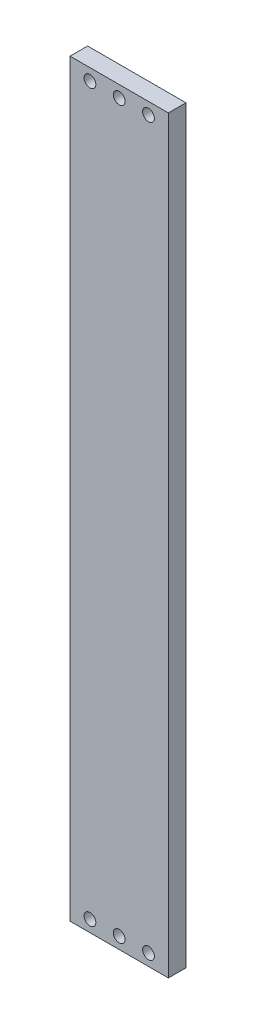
ISO-10303-21;
HEADER;
FILE_DESCRIPTION(('STEP AP214'),'2;1');
FILE_NAME('part.step','',(''),(''),'','','');
FILE_SCHEMA(('AUTOMOTIVE_DESIGN { 1 0 10303 214 1 1 1 1 }'));
ENDSEC;
DATA;
#1=APPLICATION_CONTEXT('core data for automotive mechanical design processes');
#2=APPLICATION_PROTOCOL_DEFINITION('international standard','automotive_design',2000,#1);
#3=PRODUCT_CONTEXT('',#1,'mechanical');
#4=PRODUCT('Part','Part','',(#3));
#5=PRODUCT_RELATED_PRODUCT_CATEGORY('part','',(#4));
#6=PRODUCT_DEFINITION_FORMATION('','',#4);
#7=PRODUCT_DEFINITION_CONTEXT('part definition',#1,'design');
#8=PRODUCT_DEFINITION('design','',#6,#7);
#9=PRODUCT_DEFINITION_SHAPE('','',#8);
#10=(LENGTH_UNIT() NAMED_UNIT(*) SI_UNIT(.MILLI.,.METRE.));
#11=(NAMED_UNIT(*) PLANE_ANGLE_UNIT() SI_UNIT($,.RADIAN.));
#12=(NAMED_UNIT(*) SI_UNIT($,.STERADIAN.) SOLID_ANGLE_UNIT());
#13=UNCERTAINTY_MEASURE_WITH_UNIT(LENGTH_MEASURE(1.E-05),#10,'distance_accuracy_value','');
#14=(GEOMETRIC_REPRESENTATION_CONTEXT(3) GLOBAL_UNCERTAINTY_ASSIGNED_CONTEXT((#13)) GLOBAL_UNIT_ASSIGNED_CONTEXT((#10,
#11,#12)) REPRESENTATION_CONTEXT('',''));
#15=CARTESIAN_POINT('',(0.,0.,0.));
#16=DIRECTION('',(0.,0.,1.));
#17=DIRECTION('',(1.,0.,0.));
#18=AXIS2_PLACEMENT_3D('',#15,#16,#17);
#19=CARTESIAN_POINT('',(0.,0.,3.));
#20=DIRECTION('',(0.,0.,1.));
#21=DIRECTION('',(1.,0.,0.));
#22=AXIS2_PLACEMENT_3D('',#19,#20,#21);
#23=PLANE('',#22);
#24=CARTESIAN_POINT('',(0.,2.99999999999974,3.));
#25=DIRECTION('',(0.,0.,1.));
#26=DIRECTION('',(-1.,0.,0.));
#27=AXIS2_PLACEMENT_3D('',#24,#25,#26);
#28=CIRCLE('',#27,1.00000000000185);
#29=CARTESIAN_POINT('',(-1.00000000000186,2.99999999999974,3.));
#30=VERTEX_POINT('',#29);
#31=EDGE_CURVE('E142',#30,#30,#28,.T.);
#32=ORIENTED_EDGE('',*,*,#31,.F.);
#33=EDGE_LOOP('',(#32));
#34=FACE_BOUND('',#33,.T.);
#35=CARTESIAN_POINT('',(-5.,-121.,3.));
#36=DIRECTION('',(0.,0.,1.));
#37=DIRECTION('',(1.,0.,0.));
#38=AXIS2_PLACEMENT_3D('',#35,#36,#37);
#39=CIRCLE('',#38,1.);
#40=CARTESIAN_POINT('',(-4.,-121.,3.));
#41=VERTEX_POINT('',#40);
#42=EDGE_CURVE('E130',#41,#41,#39,.T.);
#43=ORIENTED_EDGE('',*,*,#42,.F.);
#44=EDGE_LOOP('',(#43));
#45=FACE_BOUND('',#44,.T.);
#46=CARTESIAN_POINT('',(0.,-121.,3.));
#47=DIRECTION('',(0.,0.,1.));
#48=DIRECTION('',(1.,0.,0.));
#49=AXIS2_PLACEMENT_3D('',#46,#47,#48);
#50=CIRCLE('',#49,1.);
#51=CARTESIAN_POINT('',(1.,-121.,3.));
#52=VERTEX_POINT('',#51);
#53=EDGE_CURVE('E109',#52,#52,#50,.T.);
#54=ORIENTED_EDGE('',*,*,#53,.F.);
#55=EDGE_LOOP('',(#54));
#56=FACE_BOUND('',#55,.T.);
#57=DIRECTION('',(0.,-1.,0.));
#58=VECTOR('',#57,1.);
#59=CARTESIAN_POINT('',(-8.40025,5.00000000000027,3.));
#60=LINE('',#59,#58);
#61=CARTESIAN_POINT('',(-8.40025,5.00000000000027,3.));
#62=VERTEX_POINT('',#61);
#63=CARTESIAN_POINT('',(-8.40024999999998,-123.,3.));
#64=VERTEX_POINT('',#63);
#65=EDGE_CURVE('E94',#62,#64,#60,.T.);
#66=ORIENTED_EDGE('',*,*,#65,.T.);
#67=DIRECTION('',(1.,0.,0.));
#68=VECTOR('',#67,1.);
#69=CARTESIAN_POINT('',(-8.40024999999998,-123.,3.));
#70=LINE('',#69,#68);
#71=CARTESIAN_POINT('',(8.40024999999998,-123.,3.));
#72=VERTEX_POINT('',#71);
#73=EDGE_CURVE('E89',#64,#72,#70,.T.);
#74=ORIENTED_EDGE('',*,*,#73,.T.);
#75=DIRECTION('',(0.,1.,0.));
#76=VECTOR('',#75,1.);
#77=CARTESIAN_POINT('',(8.40025,5.00000000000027,3.));
#78=LINE('',#77,#76);
#79=CARTESIAN_POINT('',(8.40025,5.00000000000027,3.));
#80=VERTEX_POINT('',#79);
#81=EDGE_CURVE('E92',#72,#80,#78,.T.);
#82=ORIENTED_EDGE('',*,*,#81,.T.);
#83=DIRECTION('',(-1.,0.,0.));
#84=VECTOR('',#83,1.);
#85=CARTESIAN_POINT('',(-8.40025,5.00000000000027,3.));
#86=LINE('',#85,#84);
#87=EDGE_CURVE('E59',#80,#62,#86,.T.);
#88=ORIENTED_EDGE('',*,*,#87,.T.);
#89=EDGE_LOOP('',(#66,#74,#82,#88));
#90=FACE_BOUND('',#89,.T.);
#91=CARTESIAN_POINT('',(5.,-121.,3.));
#92=DIRECTION('',(0.,0.,1.));
#93=DIRECTION('',(1.,0.,0.));
#94=AXIS2_PLACEMENT_3D('',#91,#92,#93);
#95=CIRCLE('',#94,1.);
#96=CARTESIAN_POINT('',(6.,-121.,3.));
#97=VERTEX_POINT('',#96);
#98=EDGE_CURVE('E124',#97,#97,#95,.T.);
#99=ORIENTED_EDGE('',*,*,#98,.F.);
#100=EDGE_LOOP('',(#99));
#101=FACE_BOUND('',#100,.T.);
#102=CARTESIAN_POINT('',(4.99999999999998,2.99999999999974,3.));
#103=DIRECTION('',(0.,0.,1.));
#104=DIRECTION('',(-1.,0.,0.));
#105=AXIS2_PLACEMENT_3D('',#102,#103,#104);
#106=CIRCLE('',#105,1.00000000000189);
#107=CARTESIAN_POINT('',(3.99999999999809,2.99999999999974,3.));
#108=VERTEX_POINT('',#107);
#109=EDGE_CURVE('E136',#108,#108,#106,.T.);
#110=ORIENTED_EDGE('',*,*,#109,.F.);
#111=EDGE_LOOP('',(#110));
#112=FACE_BOUND('',#111,.T.);
#113=CARTESIAN_POINT('',(-5.00000000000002,2.99999999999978,3.));
#114=DIRECTION('',(0.,0.,1.));
#115=DIRECTION('',(-1.,0.,0.));
#116=AXIS2_PLACEMENT_3D('',#113,#114,#115);
#117=CIRCLE('',#116,1.0000000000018);
#118=CARTESIAN_POINT('',(-6.00000000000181,2.99999999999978,3.));
#119=VERTEX_POINT('',#118);
#120=EDGE_CURVE('E148',#119,#119,#117,.T.);
#121=ORIENTED_EDGE('',*,*,#120,.F.);
#122=EDGE_LOOP('',(#121));
#123=FACE_BOUND('',#122,.T.);
#124=ADVANCED_FACE('F42',(#34,#45,#56,#90,#101,#112,#123),#23,.T.);
#125=CARTESIAN_POINT('',(0.,0.,0.));
#126=DIRECTION('',(0.,0.,1.));
#127=DIRECTION('',(1.,0.,0.));
#128=AXIS2_PLACEMENT_3D('',#125,#126,#127);
#129=PLANE('',#128);
#130=DIRECTION('',(0.,-1.,0.));
#131=VECTOR('',#130,1.);
#132=CARTESIAN_POINT('',(-8.40025,5.00000000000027,0.));
#133=LINE('',#132,#131);
#134=CARTESIAN_POINT('',(-8.40025,5.00000000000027,0.));
#135=VERTEX_POINT('',#134);
#136=CARTESIAN_POINT('',(-8.40024999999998,-123.,0.));
#137=VERTEX_POINT('',#136);
#138=EDGE_CURVE('E106',#135,#137,#133,.T.);
#139=ORIENTED_EDGE('',*,*,#138,.F.);
#140=DIRECTION('',(-1.,0.,0.));
#141=VECTOR('',#140,1.);
#142=CARTESIAN_POINT('',(-8.40025,5.00000000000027,0.));
#143=LINE('',#142,#141);
#144=CARTESIAN_POINT('',(8.40025,5.00000000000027,0.));
#145=VERTEX_POINT('',#144);
#146=EDGE_CURVE('E82',#145,#135,#143,.T.);
#147=ORIENTED_EDGE('',*,*,#146,.F.);
#148=DIRECTION('',(0.,1.,0.));
#149=VECTOR('',#148,1.);
#150=CARTESIAN_POINT('',(8.40025,5.00000000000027,0.));
#151=LINE('',#150,#149);
#152=CARTESIAN_POINT('',(8.40024999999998,-123.,0.));
#153=VERTEX_POINT('',#152);
#154=EDGE_CURVE('E76',#153,#145,#151,.T.);
#155=ORIENTED_EDGE('',*,*,#154,.F.);
#156=DIRECTION('',(1.,0.,0.));
#157=VECTOR('',#156,1.);
#158=CARTESIAN_POINT('',(-8.40024999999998,-123.,0.));
#159=LINE('',#158,#157);
#160=EDGE_CURVE('E98',#137,#153,#159,.T.);
#161=ORIENTED_EDGE('',*,*,#160,.F.);
#162=EDGE_LOOP('',(#139,#147,#155,#161));
#163=FACE_BOUND('',#162,.T.);
#164=CARTESIAN_POINT('',(0.,-121.,0.));
#165=DIRECTION('',(0.,0.,1.));
#166=DIRECTION('',(1.,0.,0.));
#167=AXIS2_PLACEMENT_3D('',#164,#165,#166);
#168=CIRCLE('',#167,1.);
#169=CARTESIAN_POINT('',(1.,-121.,0.));
#170=VERTEX_POINT('',#169);
#171=EDGE_CURVE('E121',#170,#170,#168,.T.);
#172=ORIENTED_EDGE('',*,*,#171,.T.);
#173=EDGE_LOOP('',(#172));
#174=FACE_BOUND('',#173,.T.);
#175=CARTESIAN_POINT('',(5.,-121.,0.));
#176=DIRECTION('',(0.,0.,1.));
#177=DIRECTION('',(1.,0.,0.));
#178=AXIS2_PLACEMENT_3D('',#175,#176,#177);
#179=CIRCLE('',#178,1.);
#180=CARTESIAN_POINT('',(6.,-121.,0.));
#181=VERTEX_POINT('',#180);
#182=EDGE_CURVE('E127',#181,#181,#179,.T.);
#183=ORIENTED_EDGE('',*,*,#182,.T.);
#184=EDGE_LOOP('',(#183));
#185=FACE_BOUND('',#184,.T.);
#186=CARTESIAN_POINT('',(-5.,-121.,0.));
#187=DIRECTION('',(0.,0.,1.));
#188=DIRECTION('',(1.,0.,0.));
#189=AXIS2_PLACEMENT_3D('',#186,#187,#188);
#190=CIRCLE('',#189,1.);
#191=CARTESIAN_POINT('',(-4.,-121.,0.));
#192=VERTEX_POINT('',#191);
#193=EDGE_CURVE('E133',#192,#192,#190,.T.);
#194=ORIENTED_EDGE('',*,*,#193,.T.);
#195=EDGE_LOOP('',(#194));
#196=FACE_BOUND('',#195,.T.);
#197=CARTESIAN_POINT('',(4.99999999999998,2.99999999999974,0.));
#198=DIRECTION('',(0.,0.,1.));
#199=DIRECTION('',(-1.,0.,0.));
#200=AXIS2_PLACEMENT_3D('',#197,#198,#199);
#201=CIRCLE('',#200,1.00000000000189);
#202=CARTESIAN_POINT('',(3.99999999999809,2.99999999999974,0.));
#203=VERTEX_POINT('',#202);
#204=EDGE_CURVE('E139',#203,#203,#201,.T.);
#205=ORIENTED_EDGE('',*,*,#204,.T.);
#206=EDGE_LOOP('',(#205));
#207=FACE_BOUND('',#206,.T.);
#208=CARTESIAN_POINT('',(0.,2.99999999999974,0.));
#209=DIRECTION('',(0.,0.,1.));
#210=DIRECTION('',(-1.,0.,0.));
#211=AXIS2_PLACEMENT_3D('',#208,#209,#210);
#212=CIRCLE('',#211,1.00000000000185);
#213=CARTESIAN_POINT('',(-1.00000000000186,2.99999999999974,0.));
#214=VERTEX_POINT('',#213);
#215=EDGE_CURVE('E145',#214,#214,#212,.T.);
#216=ORIENTED_EDGE('',*,*,#215,.T.);
#217=EDGE_LOOP('',(#216));
#218=FACE_BOUND('',#217,.T.);
#219=CARTESIAN_POINT('',(-5.00000000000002,2.99999999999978,0.));
#220=DIRECTION('',(0.,0.,1.));
#221=DIRECTION('',(-1.,0.,0.));
#222=AXIS2_PLACEMENT_3D('',#219,#220,#221);
#223=CIRCLE('',#222,1.0000000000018);
#224=CARTESIAN_POINT('',(-6.00000000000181,2.99999999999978,0.));
#225=VERTEX_POINT('',#224);
#226=EDGE_CURVE('E151',#225,#225,#223,.T.);
#227=ORIENTED_EDGE('',*,*,#226,.T.);
#228=EDGE_LOOP('',(#227));
#229=FACE_BOUND('',#228,.T.);
#230=ADVANCED_FACE('F117',(#163,#174,#185,#196,#207,#218,#229),#129,.F.);
#231=CARTESIAN_POINT('',(-8.40025,5.00000000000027,3.));
#232=DIRECTION('',(1.,0.,0.));
#233=DIRECTION('',(0.,1.,0.));
#234=AXIS2_PLACEMENT_3D('',#231,#232,#233);
#235=PLANE('',#234);
#236=ORIENTED_EDGE('',*,*,#138,.T.);
#237=DIRECTION('',(0.,0.,-1.));
#238=VECTOR('',#237,1.);
#239=CARTESIAN_POINT('',(-8.40024999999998,-123.,3.));
#240=LINE('',#239,#238);
#241=EDGE_CURVE('E11',#64,#137,#240,.T.);
#242=ORIENTED_EDGE('',*,*,#241,.F.);
#243=ORIENTED_EDGE('',*,*,#65,.F.);
#244=DIRECTION('',(0.,0.,-1.));
#245=VECTOR('',#244,1.);
#246=CARTESIAN_POINT('',(-8.40025,5.00000000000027,3.));
#247=LINE('',#246,#245);
#248=EDGE_CURVE('E102',#62,#135,#247,.T.);
#249=ORIENTED_EDGE('',*,*,#248,.T.);
#250=EDGE_LOOP('',(#236,#242,#243,#249));
#251=FACE_BOUND('',#250,.T.);
#252=ADVANCED_FACE('F44',(#251),#235,.F.);
#253=CARTESIAN_POINT('',(-8.40024999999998,-123.,3.));
#254=DIRECTION('',(0.,1.,0.));
#255=DIRECTION('',(0.,0.,1.));
#256=AXIS2_PLACEMENT_3D('',#253,#254,#255);
#257=PLANE('',#256);
#258=ORIENTED_EDGE('',*,*,#160,.T.);
#259=DIRECTION('',(0.,0.,-1.));
#260=VECTOR('',#259,1.);
#261=CARTESIAN_POINT('',(8.40024999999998,-123.,3.));
#262=LINE('',#261,#260);
#263=EDGE_CURVE('E51',#72,#153,#262,.T.);
#264=ORIENTED_EDGE('',*,*,#263,.F.);
#265=ORIENTED_EDGE('',*,*,#73,.F.);
#266=ORIENTED_EDGE('',*,*,#241,.T.);
#267=EDGE_LOOP('',(#258,#264,#265,#266));
#268=FACE_BOUND('',#267,.T.);
#269=ADVANCED_FACE('F97',(#268),#257,.F.);
#270=CARTESIAN_POINT('',(8.40025,5.00000000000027,3.));
#271=DIRECTION('',(-1.,0.,0.));
#272=DIRECTION('',(0.,-1.,0.));
#273=AXIS2_PLACEMENT_3D('',#270,#271,#272);
#274=PLANE('',#273);
#275=ORIENTED_EDGE('',*,*,#154,.T.);
#276=DIRECTION('',(0.,0.,-1.));
#277=VECTOR('',#276,1.);
#278=CARTESIAN_POINT('',(8.40025,5.00000000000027,3.));
#279=LINE('',#278,#277);
#280=EDGE_CURVE('E99',#80,#145,#279,.T.);
#281=ORIENTED_EDGE('',*,*,#280,.F.);
#282=ORIENTED_EDGE('',*,*,#81,.F.);
#283=ORIENTED_EDGE('',*,*,#263,.T.);
#284=EDGE_LOOP('',(#275,#281,#282,#283));
#285=FACE_BOUND('',#284,.T.);
#286=ADVANCED_FACE('F100',(#285),#274,.F.);
#287=CARTESIAN_POINT('',(-8.40025,5.00000000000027,3.));
#288=DIRECTION('',(0.,-1.,0.));
#289=DIRECTION('',(0.,0.,-1.));
#290=AXIS2_PLACEMENT_3D('',#287,#288,#289);
#291=PLANE('',#290);
#292=ORIENTED_EDGE('',*,*,#146,.T.);
#293=ORIENTED_EDGE('',*,*,#248,.F.);
#294=ORIENTED_EDGE('',*,*,#87,.F.);
#295=ORIENTED_EDGE('',*,*,#280,.T.);
#296=EDGE_LOOP('',(#292,#293,#294,#295));
#297=FACE_BOUND('',#296,.T.);
#298=ADVANCED_FACE('F114',(#297),#291,.F.);
#299=CARTESIAN_POINT('',(0.,-121.,3.));
#300=DIRECTION('',(0.,0.,-1.));
#301=DIRECTION('',(-1.,0.,0.));
#302=AXIS2_PLACEMENT_3D('',#299,#300,#301);
#303=CYLINDRICAL_SURFACE('',#302,1.);
#304=ORIENTED_EDGE('',*,*,#53,.T.);
#305=EDGE_LOOP('',(#304));
#306=FACE_BOUND('',#305,.T.);
#307=ORIENTED_EDGE('',*,*,#171,.F.);
#308=EDGE_LOOP('',(#307));
#309=FACE_BOUND('',#308,.T.);
#310=ADVANCED_FACE('F170',(#306,#309),#303,.F.);
#311=CARTESIAN_POINT('',(5.,-121.,3.));
#312=DIRECTION('',(0.,0.,-1.));
#313=DIRECTION('',(-1.,0.,0.));
#314=AXIS2_PLACEMENT_3D('',#311,#312,#313);
#315=CYLINDRICAL_SURFACE('',#314,1.);
#316=ORIENTED_EDGE('',*,*,#98,.T.);
#317=EDGE_LOOP('',(#316));
#318=FACE_BOUND('',#317,.T.);
#319=ORIENTED_EDGE('',*,*,#182,.F.);
#320=EDGE_LOOP('',(#319));
#321=FACE_BOUND('',#320,.T.);
#322=ADVANCED_FACE('F215',(#318,#321),#315,.F.);
#323=CARTESIAN_POINT('',(-5.,-121.,3.));
#324=DIRECTION('',(0.,0.,-1.));
#325=DIRECTION('',(-1.,0.,0.));
#326=AXIS2_PLACEMENT_3D('',#323,#324,#325);
#327=CYLINDRICAL_SURFACE('',#326,1.);
#328=ORIENTED_EDGE('',*,*,#42,.T.);
#329=EDGE_LOOP('',(#328));
#330=FACE_BOUND('',#329,.T.);
#331=ORIENTED_EDGE('',*,*,#193,.F.);
#332=EDGE_LOOP('',(#331));
#333=FACE_BOUND('',#332,.T.);
#334=ADVANCED_FACE('F223',(#330,#333),#327,.F.);
#335=CARTESIAN_POINT('',(4.99999999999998,2.99999999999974,3.));
#336=DIRECTION('',(0.,0.,-1.));
#337=DIRECTION('',(-1.,0.,0.));
#338=AXIS2_PLACEMENT_3D('',#335,#336,#337);
#339=CYLINDRICAL_SURFACE('',#338,1.00000000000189);
#340=ORIENTED_EDGE('',*,*,#109,.T.);
#341=EDGE_LOOP('',(#340));
#342=FACE_BOUND('',#341,.T.);
#343=ORIENTED_EDGE('',*,*,#204,.F.);
#344=EDGE_LOOP('',(#343));
#345=FACE_BOUND('',#344,.T.);
#346=ADVANCED_FACE('F231',(#342,#345),#339,.F.);
#347=CARTESIAN_POINT('',(0.,2.99999999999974,3.));
#348=DIRECTION('',(0.,0.,-1.));
#349=DIRECTION('',(-1.,0.,0.));
#350=AXIS2_PLACEMENT_3D('',#347,#348,#349);
#351=CYLINDRICAL_SURFACE('',#350,1.00000000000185);
#352=ORIENTED_EDGE('',*,*,#31,.T.);
#353=EDGE_LOOP('',(#352));
#354=FACE_BOUND('',#353,.T.);
#355=ORIENTED_EDGE('',*,*,#215,.F.);
#356=EDGE_LOOP('',(#355));
#357=FACE_BOUND('',#356,.T.);
#358=ADVANCED_FACE('F240',(#354,#357),#351,.F.);
#359=CARTESIAN_POINT('',(-5.00000000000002,2.99999999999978,3.));
#360=DIRECTION('',(0.,0.,-1.));
#361=DIRECTION('',(-1.,0.,0.));
#362=AXIS2_PLACEMENT_3D('',#359,#360,#361);
#363=CYLINDRICAL_SURFACE('',#362,1.0000000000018);
#364=ORIENTED_EDGE('',*,*,#120,.T.);
#365=EDGE_LOOP('',(#364));
#366=FACE_BOUND('',#365,.T.);
#367=ORIENTED_EDGE('',*,*,#226,.F.);
#368=EDGE_LOOP('',(#367));
#369=FACE_BOUND('',#368,.T.);
#370=ADVANCED_FACE('F157',(#366,#369),#363,.F.);
#371=CLOSED_SHELL('',(#124,#230,#252,#269,#286,#298,#310,#322,#334,#346,#358,#370));
#372=MANIFOLD_SOLID_BREP('B2',#371);
#373=ADVANCED_BREP_SHAPE_REPRESENTATION('',(#18,#372),#14);
#374=SHAPE_DEFINITION_REPRESENTATION(#9,#373);
ENDSEC;
END-ISO-10303-21;
